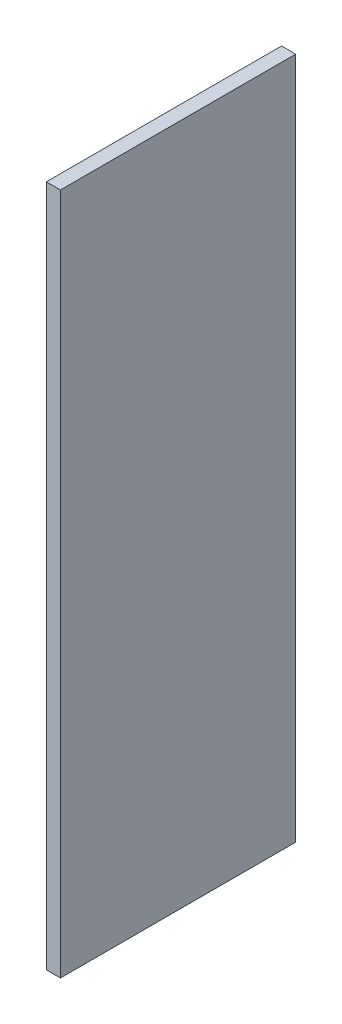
ISO-10303-21;
HEADER;
FILE_DESCRIPTION(('STEP AP214'),'2;1');
FILE_NAME('part.step','',(''),(''),'','','');
FILE_SCHEMA(('AUTOMOTIVE_DESIGN { 1 0 10303 214 1 1 1 1 }'));
ENDSEC;
DATA;
#1=APPLICATION_CONTEXT('core data for automotive mechanical design processes');
#2=APPLICATION_PROTOCOL_DEFINITION('international standard','automotive_design',2000,#1);
#3=PRODUCT_CONTEXT('',#1,'mechanical');
#4=PRODUCT('Part','Part','',(#3));
#5=PRODUCT_RELATED_PRODUCT_CATEGORY('part','',(#4));
#6=PRODUCT_DEFINITION_FORMATION('','',#4);
#7=PRODUCT_DEFINITION_CONTEXT('part definition',#1,'design');
#8=PRODUCT_DEFINITION('design','',#6,#7);
#9=PRODUCT_DEFINITION_SHAPE('','',#8);
#10=(LENGTH_UNIT() NAMED_UNIT(*) SI_UNIT(.MILLI.,.METRE.));
#11=(NAMED_UNIT(*) PLANE_ANGLE_UNIT() SI_UNIT($,.RADIAN.));
#12=(NAMED_UNIT(*) SI_UNIT($,.STERADIAN.) SOLID_ANGLE_UNIT());
#13=UNCERTAINTY_MEASURE_WITH_UNIT(LENGTH_MEASURE(1.E-05),#10,'distance_accuracy_value','');
#14=(GEOMETRIC_REPRESENTATION_CONTEXT(3) GLOBAL_UNCERTAINTY_ASSIGNED_CONTEXT((#13)) GLOBAL_UNIT_ASSIGNED_CONTEXT((#10,
#11,#12)) REPRESENTATION_CONTEXT('',''));
#15=CARTESIAN_POINT('',(0.,0.,0.));
#16=DIRECTION('',(0.,0.,1.));
#17=DIRECTION('',(1.,0.,0.));
#18=AXIS2_PLACEMENT_3D('',#15,#16,#17);
#19=CARTESIAN_POINT('',(6.00000000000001,1.93141652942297,0.));
#20=DIRECTION('',(0.,0.,-1.));
#21=DIRECTION('',(0.,1.,0.));
#22=AXIS2_PLACEMENT_3D('',#19,#20,#21);
#23=PLANE('',#22);
#24=DIRECTION('',(0.,-1.,0.));
#25=VECTOR('',#24,1.);
#26=CARTESIAN_POINT('',(0.,4.93141652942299,0.));
#27=LINE('',#26,#25);
#28=CARTESIAN_POINT('',(0.,100.,0.));
#29=VERTEX_POINT('',#28);
#30=CARTESIAN_POINT('',(0.,-45.068583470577,0.));
#31=VERTEX_POINT('',#30);
#32=EDGE_CURVE('E74',#29,#31,#27,.T.);
#33=ORIENTED_EDGE('',*,*,#32,.F.);
#34=DIRECTION('',(1.,0.,0.));
#35=VECTOR('',#34,1.);
#36=CARTESIAN_POINT('',(0.,100.,0.));
#37=LINE('',#36,#35);
#38=CARTESIAN_POINT('',(3.,100.,0.));
#39=VERTEX_POINT('',#38);
#40=EDGE_CURVE('E78',#29,#39,#37,.T.);
#41=ORIENTED_EDGE('',*,*,#40,.T.);
#42=DIRECTION('',(0.,-1.,0.));
#43=VECTOR('',#42,1.);
#44=CARTESIAN_POINT('',(3.,4.93141652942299,0.));
#45=LINE('',#44,#43);
#46=CARTESIAN_POINT('',(3.00000000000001,-45.068583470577,0.));
#47=VERTEX_POINT('',#46);
#48=EDGE_CURVE('E98',#39,#47,#45,.T.);
#49=ORIENTED_EDGE('',*,*,#48,.T.);
#50=DIRECTION('',(-1.,0.,0.));
#51=VECTOR('',#50,1.);
#52=CARTESIAN_POINT('',(3.00000000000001,-45.068583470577,0.));
#53=LINE('',#52,#51);
#54=EDGE_CURVE('E79',#47,#31,#53,.T.);
#55=ORIENTED_EDGE('',*,*,#54,.T.);
#56=EDGE_LOOP('',(#33,#41,#49,#55));
#57=FACE_BOUND('',#56,.T.);
#58=ADVANCED_FACE('F33',(#57),#23,.T.);
#59=CARTESIAN_POINT('',(0.,4.93141652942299,50.));
#60=DIRECTION('',(1.,0.,0.));
#61=DIRECTION('',(0.,1.,0.));
#62=AXIS2_PLACEMENT_3D('',#59,#60,#61);
#63=PLANE('',#62);
#64=ORIENTED_EDGE('',*,*,#32,.T.);
#65=DIRECTION('',(0.,0.,-1.));
#66=VECTOR('',#65,1.);
#67=CARTESIAN_POINT('',(0.,-45.068583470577,50.));
#68=LINE('',#67,#66);
#69=CARTESIAN_POINT('',(0.,-45.068583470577,50.));
#70=VERTEX_POINT('',#69);
#71=EDGE_CURVE('E12',#70,#31,#68,.T.);
#72=ORIENTED_EDGE('',*,*,#71,.F.);
#73=DIRECTION('',(0.,-1.,0.));
#74=VECTOR('',#73,1.);
#75=CARTESIAN_POINT('',(0.,4.93141652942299,50.));
#76=LINE('',#75,#74);
#77=CARTESIAN_POINT('',(0.,100.,50.));
#78=VERTEX_POINT('',#77);
#79=EDGE_CURVE('E54',#78,#70,#76,.T.);
#80=ORIENTED_EDGE('',*,*,#79,.F.);
#81=DIRECTION('',(0.,0.,-1.));
#82=VECTOR('',#81,1.);
#83=CARTESIAN_POINT('',(0.,100.,50.));
#84=LINE('',#83,#82);
#85=EDGE_CURVE('E81',#78,#29,#84,.T.);
#86=ORIENTED_EDGE('',*,*,#85,.T.);
#87=EDGE_LOOP('',(#64,#72,#80,#86));
#88=FACE_BOUND('',#87,.T.);
#89=ADVANCED_FACE('F84',(#88),#63,.F.);
#90=CARTESIAN_POINT('',(3.00000000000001,-45.068583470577,50.));
#91=DIRECTION('',(0.,-1.,0.));
#92=DIRECTION('',(1.,0.,0.));
#93=AXIS2_PLACEMENT_3D('',#90,#91,#92);
#94=PLANE('',#93);
#95=ORIENTED_EDGE('',*,*,#54,.F.);
#96=DIRECTION('',(0.,0.,-1.));
#97=VECTOR('',#96,1.);
#98=CARTESIAN_POINT('',(3.00000000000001,-45.068583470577,50.));
#99=LINE('',#98,#97);
#100=CARTESIAN_POINT('',(3.00000000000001,-45.068583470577,50.));
#101=VERTEX_POINT('',#100);
#102=EDGE_CURVE('E41',#101,#47,#99,.T.);
#103=ORIENTED_EDGE('',*,*,#102,.F.);
#104=DIRECTION('',(-1.,0.,0.));
#105=VECTOR('',#104,1.);
#106=CARTESIAN_POINT('',(3.00000000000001,-45.068583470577,50.));
#107=LINE('',#106,#105);
#108=EDGE_CURVE('E101',#101,#70,#107,.T.);
#109=ORIENTED_EDGE('',*,*,#108,.T.);
#110=ORIENTED_EDGE('',*,*,#71,.T.);
#111=EDGE_LOOP('',(#95,#103,#109,#110));
#112=FACE_BOUND('',#111,.T.);
#113=ADVANCED_FACE('F106',(#112),#94,.T.);
#114=CARTESIAN_POINT('',(3.,100.,50.));
#115=DIRECTION('',(1.,0.,0.));
#116=DIRECTION('',(0.,1.,0.));
#117=AXIS2_PLACEMENT_3D('',#114,#115,#116);
#118=PLANE('',#117);
#119=ORIENTED_EDGE('',*,*,#48,.F.);
#120=DIRECTION('',(0.,0.,-1.));
#121=VECTOR('',#120,1.);
#122=CARTESIAN_POINT('',(3.,100.,50.));
#123=LINE('',#122,#121);
#124=CARTESIAN_POINT('',(3.,100.,50.));
#125=VERTEX_POINT('',#124);
#126=EDGE_CURVE('E91',#125,#39,#123,.T.);
#127=ORIENTED_EDGE('',*,*,#126,.F.);
#128=DIRECTION('',(0.,-1.,0.));
#129=VECTOR('',#128,1.);
#130=CARTESIAN_POINT('',(3.,4.93141652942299,50.));
#131=LINE('',#130,#129);
#132=EDGE_CURVE('E103',#125,#101,#131,.T.);
#133=ORIENTED_EDGE('',*,*,#132,.T.);
#134=ORIENTED_EDGE('',*,*,#102,.T.);
#135=EDGE_LOOP('',(#119,#127,#133,#134));
#136=FACE_BOUND('',#135,.T.);
#137=ADVANCED_FACE('F35',(#136),#118,.T.);
#138=CARTESIAN_POINT('',(6.,-1.06858347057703,50.));
#139=DIRECTION('',(0.,0.,1.));
#140=DIRECTION('',(0.,-1.,0.));
#141=AXIS2_PLACEMENT_3D('',#138,#139,#140);
#142=PLANE('',#141);
#143=ORIENTED_EDGE('',*,*,#79,.T.);
#144=ORIENTED_EDGE('',*,*,#108,.F.);
#145=ORIENTED_EDGE('',*,*,#132,.F.);
#146=DIRECTION('',(1.,0.,0.));
#147=VECTOR('',#146,1.);
#148=CARTESIAN_POINT('',(0.,100.,50.));
#149=LINE('',#148,#147);
#150=EDGE_CURVE('E93',#78,#125,#149,.T.);
#151=ORIENTED_EDGE('',*,*,#150,.F.);
#152=EDGE_LOOP('',(#143,#144,#145,#151));
#153=FACE_BOUND('',#152,.T.);
#154=ADVANCED_FACE('F107',(#153),#142,.T.);
#155=CARTESIAN_POINT('',(0.,100.,50.));
#156=DIRECTION('',(0.,1.,0.));
#157=DIRECTION('',(0.,0.,1.));
#158=AXIS2_PLACEMENT_3D('',#155,#156,#157);
#159=PLANE('',#158);
#160=ORIENTED_EDGE('',*,*,#40,.F.);
#161=ORIENTED_EDGE('',*,*,#85,.F.);
#162=ORIENTED_EDGE('',*,*,#150,.T.);
#163=ORIENTED_EDGE('',*,*,#126,.T.);
#164=EDGE_LOOP('',(#160,#161,#162,#163));
#165=FACE_BOUND('',#164,.T.);
#166=ADVANCED_FACE('F89',(#165),#159,.T.);
#167=CLOSED_SHELL('',(#58,#89,#113,#137,#154,#166));
#168=MANIFOLD_SOLID_BREP('B2',#167);
#169=ADVANCED_BREP_SHAPE_REPRESENTATION('',(#18,#168),#14);
#170=SHAPE_DEFINITION_REPRESENTATION(#9,#169);
ENDSEC;
END-ISO-10303-21;
